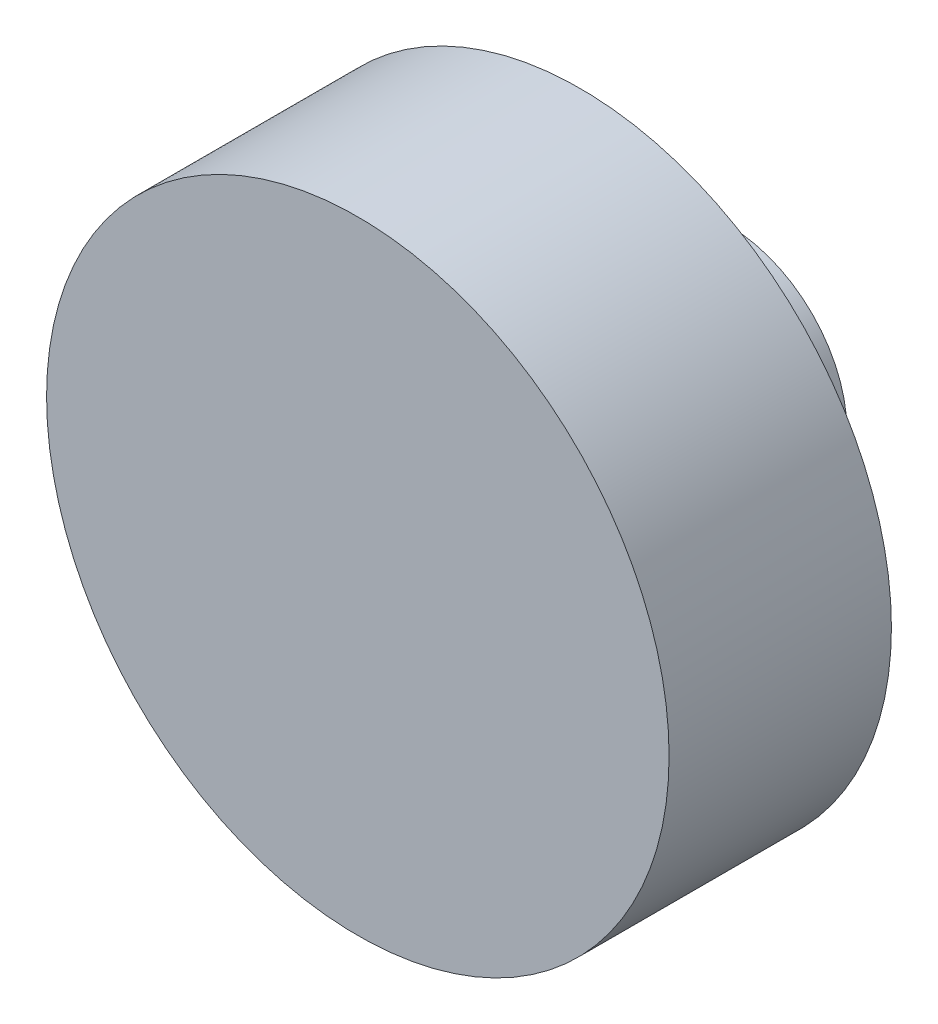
ISO-10303-21;
HEADER;
FILE_DESCRIPTION(('STEP AP214'),'2;1');
FILE_NAME('part.step','',(''),(''),'','','');
FILE_SCHEMA(('AUTOMOTIVE_DESIGN { 1 0 10303 214 1 1 1 1 }'));
ENDSEC;
DATA;
#1=APPLICATION_CONTEXT('core data for automotive mechanical design processes');
#2=APPLICATION_PROTOCOL_DEFINITION('international standard','automotive_design',2000,#1);
#3=PRODUCT_CONTEXT('',#1,'mechanical');
#4=PRODUCT('Part','Part','',(#3));
#5=PRODUCT_RELATED_PRODUCT_CATEGORY('part','',(#4));
#6=PRODUCT_DEFINITION_FORMATION('','',#4);
#7=PRODUCT_DEFINITION_CONTEXT('part definition',#1,'design');
#8=PRODUCT_DEFINITION('design','',#6,#7);
#9=PRODUCT_DEFINITION_SHAPE('','',#8);
#10=(LENGTH_UNIT() NAMED_UNIT(*) SI_UNIT(.MILLI.,.METRE.));
#11=(NAMED_UNIT(*) PLANE_ANGLE_UNIT() SI_UNIT($,.RADIAN.));
#12=(NAMED_UNIT(*) SI_UNIT($,.STERADIAN.) SOLID_ANGLE_UNIT());
#13=UNCERTAINTY_MEASURE_WITH_UNIT(LENGTH_MEASURE(1.E-05),#10,'distance_accuracy_value','');
#14=(GEOMETRIC_REPRESENTATION_CONTEXT(3) GLOBAL_UNCERTAINTY_ASSIGNED_CONTEXT((#13)) GLOBAL_UNIT_ASSIGNED_CONTEXT((#10,
#11,#12)) REPRESENTATION_CONTEXT('',''));
#15=CARTESIAN_POINT('',(0.,0.,0.));
#16=DIRECTION('',(0.,0.,1.));
#17=DIRECTION('',(1.,0.,0.));
#18=AXIS2_PLACEMENT_3D('',#15,#16,#17);
#19=CARTESIAN_POINT('',(-74.7807878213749,0.,10.));
#20=DIRECTION('',(0.,0.,-1.));
#21=DIRECTION('',(-1.,0.,0.));
#22=AXIS2_PLACEMENT_3D('',#19,#20,#21);
#23=CYLINDRICAL_SURFACE('',#22,8.00000000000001);
#24=CARTESIAN_POINT('',(-74.7807878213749,0.,10.));
#25=DIRECTION('',(0.,0.,1.));
#26=DIRECTION('',(1.,0.,0.));
#27=AXIS2_PLACEMENT_3D('',#24,#25,#26);
#28=CIRCLE('',#27,8.00000000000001);
#29=CARTESIAN_POINT('',(-66.7807878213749,0.,10.));
#30=VERTEX_POINT('',#29);
#31=EDGE_CURVE('E10',#30,#30,#28,.T.);
#32=ORIENTED_EDGE('',*,*,#31,.F.);
#33=EDGE_LOOP('',(#32));
#34=FACE_BOUND('',#33,.T.);
#35=CARTESIAN_POINT('',(-74.7807878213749,0.,0.));
#36=DIRECTION('',(0.,0.,1.));
#37=DIRECTION('',(1.,0.,0.));
#38=AXIS2_PLACEMENT_3D('',#35,#36,#37);
#39=CIRCLE('',#38,8.00000000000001);
#40=CARTESIAN_POINT('',(-66.7807878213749,0.,0.));
#41=VERTEX_POINT('',#40);
#42=EDGE_CURVE('E34',#41,#41,#39,.T.);
#43=ORIENTED_EDGE('',*,*,#42,.T.);
#44=EDGE_LOOP('',(#43));
#45=FACE_BOUND('',#44,.T.);
#46=ADVANCED_FACE('F28',(#34,#45),#23,.T.);
#47=CARTESIAN_POINT('',(-74.7807878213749,0.,0.));
#48=DIRECTION('',(0.,0.,1.));
#49=DIRECTION('',(1.,0.,0.));
#50=AXIS2_PLACEMENT_3D('',#47,#48,#49);
#51=PLANE('',#50);
#52=ORIENTED_EDGE('',*,*,#42,.F.);
#53=EDGE_LOOP('',(#52));
#54=FACE_BOUND('',#53,.T.);
#55=ADVANCED_FACE('F52',(#54),#51,.F.);
#56=CARTESIAN_POINT('',(-74.7807878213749,0.,10.));
#57=DIRECTION('',(0.,0.,1.));
#58=DIRECTION('',(1.,0.,0.));
#59=AXIS2_PLACEMENT_3D('',#56,#57,#58);
#60=PLANE('',#59);
#61=CARTESIAN_POINT('',(-74.7807878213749,0.,10.));
#62=DIRECTION('',(0.,0.,1.));
#63=DIRECTION('',(1.,0.,0.));
#64=AXIS2_PLACEMENT_3D('',#61,#62,#63);
#65=CIRCLE('',#64,21.);
#66=CARTESIAN_POINT('',(-53.7807878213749,0.,10.));
#67=VERTEX_POINT('',#66);
#68=EDGE_CURVE('E42',#67,#67,#65,.T.);
#69=ORIENTED_EDGE('',*,*,#68,.F.);
#70=EDGE_LOOP('',(#69));
#71=FACE_BOUND('',#70,.T.);
#72=ORIENTED_EDGE('',*,*,#31,.T.);
#73=EDGE_LOOP('',(#72));
#74=FACE_BOUND('',#73,.T.);
#75=ADVANCED_FACE('F50',(#71,#74),#60,.F.);
#76=CARTESIAN_POINT('',(-74.7807878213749,0.,25.));
#77=DIRECTION('',(0.,0.,-1.));
#78=DIRECTION('',(-1.,0.,0.));
#79=AXIS2_PLACEMENT_3D('',#76,#77,#78);
#80=CYLINDRICAL_SURFACE('',#79,21.);
#81=CARTESIAN_POINT('',(-74.7807878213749,0.,25.));
#82=DIRECTION('',(0.,0.,1.));
#83=DIRECTION('',(1.,0.,0.));
#84=AXIS2_PLACEMENT_3D('',#81,#82,#83);
#85=CIRCLE('',#84,21.);
#86=CARTESIAN_POINT('',(-53.7807878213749,0.,25.));
#87=VERTEX_POINT('',#86);
#88=EDGE_CURVE('E38',#87,#87,#85,.T.);
#89=ORIENTED_EDGE('',*,*,#88,.F.);
#90=EDGE_LOOP('',(#89));
#91=FACE_BOUND('',#90,.T.);
#92=ORIENTED_EDGE('',*,*,#68,.T.);
#93=EDGE_LOOP('',(#92));
#94=FACE_BOUND('',#93,.T.);
#95=ADVANCED_FACE('F48',(#91,#94),#80,.T.);
#96=CARTESIAN_POINT('',(-74.7807878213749,0.,25.));
#97=DIRECTION('',(0.,0.,1.));
#98=DIRECTION('',(1.,0.,0.));
#99=AXIS2_PLACEMENT_3D('',#96,#97,#98);
#100=PLANE('',#99);
#101=ORIENTED_EDGE('',*,*,#88,.T.);
#102=EDGE_LOOP('',(#101));
#103=FACE_BOUND('',#102,.T.);
#104=ADVANCED_FACE('F58',(#103),#100,.T.);
#105=CLOSED_SHELL('',(#46,#55,#75,#95,#104));
#106=MANIFOLD_SOLID_BREP('B2',#105);
#107=ADVANCED_BREP_SHAPE_REPRESENTATION('',(#18,#106),#14);
#108=SHAPE_DEFINITION_REPRESENTATION(#9,#107);
ENDSEC;
END-ISO-10303-21;
